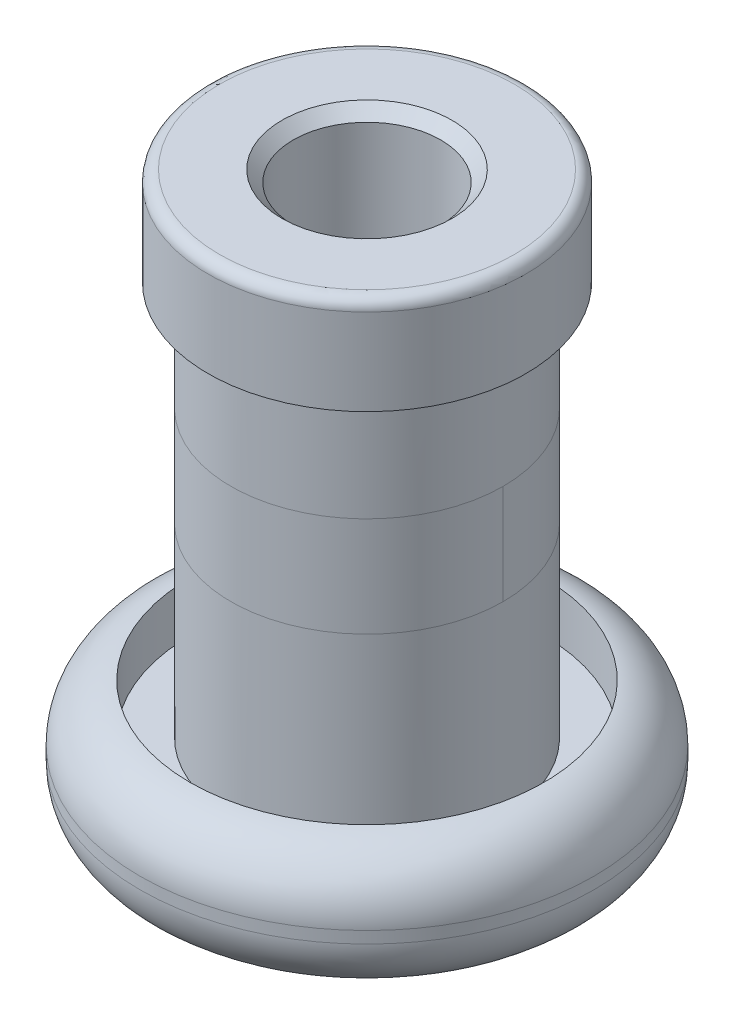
ISO-10303-21;
HEADER;
FILE_DESCRIPTION(('STEP AP214'),'2;1');
FILE_NAME('part.step','',(''),(''),'','','');
FILE_SCHEMA(('AUTOMOTIVE_DESIGN { 1 0 10303 214 1 1 1 1 }'));
ENDSEC;
DATA;
#1=APPLICATION_CONTEXT('core data for automotive mechanical design processes');
#2=APPLICATION_PROTOCOL_DEFINITION('international standard','automotive_design',2000,#1);
#3=PRODUCT_CONTEXT('',#1,'mechanical');
#4=PRODUCT('Part','Part','',(#3));
#5=PRODUCT_RELATED_PRODUCT_CATEGORY('part','',(#4));
#6=PRODUCT_DEFINITION_FORMATION('','',#4);
#7=PRODUCT_DEFINITION_CONTEXT('part definition',#1,'design');
#8=PRODUCT_DEFINITION('design','',#6,#7);
#9=PRODUCT_DEFINITION_SHAPE('','',#8);
#10=(LENGTH_UNIT() NAMED_UNIT(*) SI_UNIT(.MILLI.,.METRE.));
#11=(NAMED_UNIT(*) PLANE_ANGLE_UNIT() SI_UNIT($,.RADIAN.));
#12=(NAMED_UNIT(*) SI_UNIT($,.STERADIAN.) SOLID_ANGLE_UNIT());
#13=UNCERTAINTY_MEASURE_WITH_UNIT(LENGTH_MEASURE(1.E-05),#10,'distance_accuracy_value','');
#14=(GEOMETRIC_REPRESENTATION_CONTEXT(3) GLOBAL_UNCERTAINTY_ASSIGNED_CONTEXT((#13)) GLOBAL_UNIT_ASSIGNED_CONTEXT((#10,
#11,#12)) REPRESENTATION_CONTEXT('',''));
#15=CARTESIAN_POINT('',(0.,0.,0.));
#16=DIRECTION('',(0.,0.,1.));
#17=DIRECTION('',(1.,0.,0.));
#18=AXIS2_PLACEMENT_3D('',#15,#16,#17);
#19=CARTESIAN_POINT('',(0.,0.,0.));
#20=DIRECTION('',(0.,-1.,0.));
#21=DIRECTION('',(0.,0.,-1.));
#22=AXIS2_PLACEMENT_3D('',#19,#20,#21);
#23=CYLINDRICAL_SURFACE('',#22,7.62);
#24=CARTESIAN_POINT('',(0.,14.605,0.));
#25=DIRECTION('',(0.,1.,0.));
#26=DIRECTION('',(0.,0.,1.));
#27=AXIS2_PLACEMENT_3D('',#24,#25,#26);
#28=CIRCLE('',#27,7.62);
#29=CARTESIAN_POINT('',(-7.62,14.605,0.));
#30=VERTEX_POINT('',#29);
#31=CARTESIAN_POINT('',(7.62,14.605,0.));
#32=VERTEX_POINT('',#31);
#33=EDGE_CURVE('E43',#30,#32,#28,.F.);
#34=ORIENTED_EDGE('',*,*,#33,.F.);
#35=DIRECTION('',(0.,-1.,0.));
#36=VECTOR('',#35,1.);
#37=CARTESIAN_POINT('',(-7.62,0.,0.));
#38=LINE('',#37,#36);
#39=CARTESIAN_POINT('',(-7.62,20.193,0.));
#40=VERTEX_POINT('',#39);
#41=EDGE_CURVE('E11',#30,#40,#38,.F.);
#42=ORIENTED_EDGE('',*,*,#41,.T.);
#43=CARTESIAN_POINT('',(0.,20.193,0.));
#44=DIRECTION('',(0.,-1.,0.));
#45=DIRECTION('',(0.,0.,-1.));
#46=AXIS2_PLACEMENT_3D('',#43,#44,#45);
#47=CIRCLE('',#46,7.62);
#48=CARTESIAN_POINT('',(7.62,20.193,0.));
#49=VERTEX_POINT('',#48);
#50=EDGE_CURVE('E71',#49,#40,#47,.F.);
#51=ORIENTED_EDGE('',*,*,#50,.F.);
#52=DIRECTION('',(0.,-1.,0.));
#53=VECTOR('',#52,1.);
#54=CARTESIAN_POINT('',(7.62,0.,0.));
#55=LINE('',#54,#53);
#56=EDGE_CURVE('E59',#32,#49,#55,.F.);
#57=ORIENTED_EDGE('',*,*,#56,.F.);
#58=EDGE_LOOP('',(#34,#42,#51,#57));
#59=FACE_BOUND('',#58,.T.);
#60=ADVANCED_FACE('F34',(#59),#23,.T.);
#61=CARTESIAN_POINT('',(0.,4.191,0.));
#62=DIRECTION('',(0.,-1.,0.));
#63=DIRECTION('',(0.,0.,-1.));
#64=AXIS2_PLACEMENT_3D('',#61,#62,#63);
#65=CIRCLE('',#64,7.62);
#66=CARTESIAN_POINT('',(0.,4.191,-7.62));
#67=VERTEX_POINT('',#66);
#68=EDGE_CURVE('E161',#67,#67,#65,.T.);
#69=ORIENTED_EDGE('',*,*,#68,.F.);
#70=EDGE_LOOP('',(#69));
#71=FACE_BOUND('',#70,.T.);
#72=EDGE_CURVE('E64',#32,#30,#28,.F.);
#73=ORIENTED_EDGE('',*,*,#72,.T.);
#74=ORIENTED_EDGE('',*,*,#33,.T.);
#75=EDGE_LOOP('',(#73,#74));
#76=FACE_BOUND('',#75,.T.);
#77=ADVANCED_FACE('F94',(#71,#76),#23,.T.);
#78=CARTESIAN_POINT('',(0.,26.289,0.));
#79=DIRECTION('',(0.,-1.,0.));
#80=DIRECTION('',(0.,0.,-1.));
#81=AXIS2_PLACEMENT_3D('',#78,#79,#80);
#82=CIRCLE('',#81,7.62);
#83=CARTESIAN_POINT('',(0.,26.289,-7.62));
#84=VERTEX_POINT('',#83);
#85=EDGE_CURVE('E158',#84,#84,#82,.T.);
#86=ORIENTED_EDGE('',*,*,#85,.T.);
#87=EDGE_LOOP('',(#86));
#88=FACE_BOUND('',#87,.T.);
#89=ORIENTED_EDGE('',*,*,#50,.T.);
#90=EDGE_CURVE('E62',#40,#49,#47,.F.);
#91=ORIENTED_EDGE('',*,*,#90,.T.);
#92=EDGE_LOOP('',(#89,#91));
#93=FACE_BOUND('',#92,.T.);
#94=ADVANCED_FACE('F70',(#88,#93),#23,.T.);
#95=CARTESIAN_POINT('',(0.,3.83294289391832,0.));
#96=DIRECTION('',(0.,-1.,0.));
#97=DIRECTION('',(0.,0.,-1.));
#98=AXIS2_PLACEMENT_3D('',#95,#96,#97);
#99=TOROIDAL_SURFACE('',#98,9.525,3.175);
#100=CARTESIAN_POINT('',(0.,6.985,0.));
#101=DIRECTION('',(0.,-1.,0.));
#102=DIRECTION('',(0.,0.,-1.));
#103=AXIS2_PLACEMENT_3D('',#100,#101,#102);
#104=CIRCLE('',#103,9.906);
#105=CARTESIAN_POINT('',(0.,6.985,-9.906));
#106=VERTEX_POINT('',#105);
#107=EDGE_CURVE('E127',#106,#106,#104,.T.);
#108=ORIENTED_EDGE('',*,*,#107,.T.);
#109=EDGE_LOOP('',(#108));
#110=FACE_BOUND('',#109,.T.);
#111=CARTESIAN_POINT('',(0.,3.83294289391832,0.));
#112=DIRECTION('',(0.,-1.,0.));
#113=DIRECTION('',(0.,0.,-1.));
#114=AXIS2_PLACEMENT_3D('',#111,#112,#113);
#115=CIRCLE('',#114,12.7);
#116=CARTESIAN_POINT('',(0.,3.83294289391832,-12.7));
#117=VERTEX_POINT('',#116);
#118=EDGE_CURVE('E130',#117,#117,#115,.T.);
#119=ORIENTED_EDGE('',*,*,#118,.F.);
#120=EDGE_LOOP('',(#119));
#121=FACE_BOUND('',#120,.T.);
#122=ADVANCED_FACE('F103',(#110,#121),#99,.T.);
#123=CARTESIAN_POINT('',(0.,0.,0.));
#124=DIRECTION('',(0.,-1.,0.));
#125=DIRECTION('',(0.,0.,-1.));
#126=AXIS2_PLACEMENT_3D('',#123,#124,#125);
#127=CYLINDRICAL_SURFACE('',#126,9.906);
#128=CARTESIAN_POINT('',(0.,4.191,0.));
#129=DIRECTION('',(0.,-1.,0.));
#130=DIRECTION('',(0.,0.,-1.));
#131=AXIS2_PLACEMENT_3D('',#128,#129,#130);
#132=CIRCLE('',#131,9.906);
#133=CARTESIAN_POINT('',(0.,4.191,-9.906));
#134=VERTEX_POINT('',#133);
#135=EDGE_CURVE('E164',#134,#134,#132,.T.);
#136=ORIENTED_EDGE('',*,*,#135,.T.);
#137=EDGE_LOOP('',(#136));
#138=FACE_BOUND('',#137,.T.);
#139=ORIENTED_EDGE('',*,*,#107,.F.);
#140=EDGE_LOOP('',(#139));
#141=FACE_BOUND('',#140,.T.);
#142=ADVANCED_FACE('F114',(#138,#141),#127,.F.);
#143=CARTESIAN_POINT('',(7.62,4.191,0.));
#144=DIRECTION('',(0.,1.,0.));
#145=DIRECTION('',(0.,0.,1.));
#146=AXIS2_PLACEMENT_3D('',#143,#144,#145);
#147=PLANE('',#146);
#148=ORIENTED_EDGE('',*,*,#68,.T.);
#149=EDGE_LOOP('',(#148));
#150=FACE_BOUND('',#149,.T.);
#151=ORIENTED_EDGE('',*,*,#135,.F.);
#152=EDGE_LOOP('',(#151));
#153=FACE_BOUND('',#152,.T.);
#154=ADVANCED_FACE('F110',(#150,#153),#147,.T.);
#155=ORIENTED_EDGE('',*,*,#41,.F.);
#156=ORIENTED_EDGE('',*,*,#72,.F.);
#157=ORIENTED_EDGE('',*,*,#56,.T.);
#158=ORIENTED_EDGE('',*,*,#90,.F.);
#159=EDGE_LOOP('',(#155,#156,#157,#158));
#160=FACE_BOUND('',#159,.T.);
#161=ADVANCED_FACE('F61',(#160),#23,.T.);
#162=CARTESIAN_POINT('',(8.89,26.289,0.));
#163=DIRECTION('',(0.,-1.,0.));
#164=DIRECTION('',(0.,0.,-1.));
#165=AXIS2_PLACEMENT_3D('',#162,#163,#164);
#166=PLANE('',#165);
#167=CARTESIAN_POINT('',(0.,26.289,0.));
#168=DIRECTION('',(0.,-1.,0.));
#169=DIRECTION('',(0.,0.,-1.));
#170=AXIS2_PLACEMENT_3D('',#167,#168,#169);
#171=CIRCLE('',#170,8.89);
#172=CARTESIAN_POINT('',(0.,26.289,-8.89));
#173=VERTEX_POINT('',#172);
#174=EDGE_CURVE('E155',#173,#173,#171,.T.);
#175=ORIENTED_EDGE('',*,*,#174,.T.);
#176=EDGE_LOOP('',(#175));
#177=FACE_BOUND('',#176,.T.);
#178=ORIENTED_EDGE('',*,*,#85,.F.);
#179=EDGE_LOOP('',(#178));
#180=FACE_BOUND('',#179,.T.);
#181=ADVANCED_FACE('F109',(#177,#180),#166,.T.);
#182=CARTESIAN_POINT('',(0.,0.,0.));
#183=DIRECTION('',(0.,-1.,0.));
#184=DIRECTION('',(0.,0.,-1.));
#185=AXIS2_PLACEMENT_3D('',#182,#183,#184);
#186=CYLINDRICAL_SURFACE('',#185,8.89);
#187=CARTESIAN_POINT('',(0.,31.115,0.));
#188=DIRECTION('',(0.,-1.,0.));
#189=DIRECTION('',(0.,0.,-1.));
#190=AXIS2_PLACEMENT_3D('',#187,#188,#189);
#191=CIRCLE('',#190,8.89);
#192=CARTESIAN_POINT('',(0.,31.115,-8.89));
#193=VERTEX_POINT('',#192);
#194=EDGE_CURVE('E152',#193,#193,#191,.T.);
#195=ORIENTED_EDGE('',*,*,#194,.T.);
#196=EDGE_LOOP('',(#195));
#197=FACE_BOUND('',#196,.T.);
#198=ORIENTED_EDGE('',*,*,#174,.F.);
#199=EDGE_LOOP('',(#198));
#200=FACE_BOUND('',#199,.T.);
#201=ADVANCED_FACE('F205',(#197,#200),#186,.T.);
#202=CARTESIAN_POINT('',(0.,31.115,0.));
#203=DIRECTION('',(0.,-1.,0.));
#204=DIRECTION('',(0.,0.,-1.));
#205=AXIS2_PLACEMENT_3D('',#202,#203,#204);
#206=TOROIDAL_SURFACE('',#205,8.255,0.635);
#207=CARTESIAN_POINT('',(0.,31.75,0.));
#208=DIRECTION('',(0.,-1.,0.));
#209=DIRECTION('',(0.,0.,-1.));
#210=AXIS2_PLACEMENT_3D('',#207,#208,#209);
#211=CIRCLE('',#210,8.255);
#212=CARTESIAN_POINT('',(0.,31.75,-8.255));
#213=VERTEX_POINT('',#212);
#214=EDGE_CURVE('E149',#213,#213,#211,.T.);
#215=ORIENTED_EDGE('',*,*,#214,.T.);
#216=EDGE_LOOP('',(#215));
#217=FACE_BOUND('',#216,.T.);
#218=ORIENTED_EDGE('',*,*,#194,.F.);
#219=EDGE_LOOP('',(#218));
#220=FACE_BOUND('',#219,.T.);
#221=ADVANCED_FACE('F203',(#217,#220),#206,.T.);
#222=CARTESIAN_POINT('',(4.1275,31.75,0.));
#223=DIRECTION('',(0.,1.,0.));
#224=DIRECTION('',(0.,0.,1.));
#225=AXIS2_PLACEMENT_3D('',#222,#223,#224);
#226=PLANE('',#225);
#227=CARTESIAN_POINT('',(0.,31.75,0.));
#228=DIRECTION('',(0.,1.,0.));
#229=DIRECTION('',(0.,0.,1.));
#230=AXIS2_PLACEMENT_3D('',#227,#228,#229);
#231=CIRCLE('',#230,4.7625);
#232=CARTESIAN_POINT('',(0.,31.75,4.7625));
#233=VERTEX_POINT('',#232);
#234=EDGE_CURVE('E79',#233,#233,#231,.F.);
#235=ORIENTED_EDGE('',*,*,#234,.T.);
#236=EDGE_LOOP('',(#235));
#237=FACE_BOUND('',#236,.T.);
#238=ORIENTED_EDGE('',*,*,#214,.F.);
#239=EDGE_LOOP('',(#238));
#240=FACE_BOUND('',#239,.T.);
#241=ADVANCED_FACE('F170',(#237,#240),#226,.T.);
#242=CARTESIAN_POINT('',(0.,0.,0.));
#243=DIRECTION('',(0.,-1.,0.));
#244=DIRECTION('',(0.,0.,-1.));
#245=AXIS2_PLACEMENT_3D('',#242,#243,#244);
#246=CYLINDRICAL_SURFACE('',#245,4.1275);
#247=CARTESIAN_POINT('',(0.,31.115,0.));
#248=DIRECTION('',(0.,1.,0.));
#249=DIRECTION('',(0.,0.,1.));
#250=AXIS2_PLACEMENT_3D('',#247,#248,#249);
#251=CIRCLE('',#250,4.1275);
#252=CARTESIAN_POINT('',(0.,31.115,4.1275));
#253=VERTEX_POINT('',#252);
#254=EDGE_CURVE('E75',#253,#253,#251,.T.);
#255=ORIENTED_EDGE('',*,*,#254,.T.);
#256=EDGE_LOOP('',(#255));
#257=FACE_BOUND('',#256,.T.);
#258=CARTESIAN_POINT('',(0.,3.175,0.));
#259=DIRECTION('',(0.,-1.,0.));
#260=DIRECTION('',(0.,0.,-1.));
#261=AXIS2_PLACEMENT_3D('',#258,#259,#260);
#262=CIRCLE('',#261,4.1275);
#263=CARTESIAN_POINT('',(0.,3.175,-4.1275));
#264=VERTEX_POINT('',#263);
#265=EDGE_CURVE('E146',#264,#264,#262,.T.);
#266=ORIENTED_EDGE('',*,*,#265,.T.);
#267=EDGE_LOOP('',(#266));
#268=FACE_BOUND('',#267,.T.);
#269=ADVANCED_FACE('F183',(#257,#268),#246,.F.);
#270=CARTESIAN_POINT('',(5.3975,3.175,0.));
#271=DIRECTION('',(0.,-1.,0.));
#272=DIRECTION('',(0.,0.,-1.));
#273=AXIS2_PLACEMENT_3D('',#270,#271,#272);
#274=PLANE('',#273);
#275=CARTESIAN_POINT('',(0.,3.175,0.));
#276=DIRECTION('',(0.,-1.,0.));
#277=DIRECTION('',(0.,0.,-1.));
#278=AXIS2_PLACEMENT_3D('',#275,#276,#277);
#279=CIRCLE('',#278,5.3975);
#280=CARTESIAN_POINT('',(0.,3.175,-5.3975));
#281=VERTEX_POINT('',#280);
#282=EDGE_CURVE('E143',#281,#281,#279,.T.);
#283=ORIENTED_EDGE('',*,*,#282,.T.);
#284=EDGE_LOOP('',(#283));
#285=FACE_BOUND('',#284,.T.);
#286=ORIENTED_EDGE('',*,*,#265,.F.);
#287=EDGE_LOOP('',(#286));
#288=FACE_BOUND('',#287,.T.);
#289=ADVANCED_FACE('F186',(#285,#288),#274,.T.);
#290=CARTESIAN_POINT('',(0.,0.,0.));
#291=DIRECTION('',(0.,-1.,0.));
#292=DIRECTION('',(0.,0.,-1.));
#293=AXIS2_PLACEMENT_3D('',#290,#291,#292);
#294=CYLINDRICAL_SURFACE('',#293,5.3975);
#295=CARTESIAN_POINT('',(0.,0.,0.));
#296=DIRECTION('',(0.,-1.,0.));
#297=DIRECTION('',(0.,0.,-1.));
#298=AXIS2_PLACEMENT_3D('',#295,#296,#297);
#299=CIRCLE('',#298,5.3975);
#300=CARTESIAN_POINT('',(0.,0.,-5.3975));
#301=VERTEX_POINT('',#300);
#302=EDGE_CURVE('E140',#301,#301,#299,.T.);
#303=ORIENTED_EDGE('',*,*,#302,.T.);
#304=EDGE_LOOP('',(#303));
#305=FACE_BOUND('',#304,.T.);
#306=ORIENTED_EDGE('',*,*,#282,.F.);
#307=EDGE_LOOP('',(#306));
#308=FACE_BOUND('',#307,.T.);
#309=ADVANCED_FACE('F191',(#305,#308),#294,.F.);
#310=CARTESIAN_POINT('',(5.3975,0.,0.));
#311=DIRECTION('',(0.,-1.,0.));
#312=DIRECTION('',(0.,0.,-1.));
#313=AXIS2_PLACEMENT_3D('',#310,#311,#312);
#314=PLANE('',#313);
#315=CARTESIAN_POINT('',(0.,0.,0.));
#316=DIRECTION('',(0.,-1.,0.));
#317=DIRECTION('',(0.,0.,-1.));
#318=AXIS2_PLACEMENT_3D('',#315,#316,#317);
#319=CIRCLE('',#318,9.525);
#320=CARTESIAN_POINT('',(0.,0.,-9.525));
#321=VERTEX_POINT('',#320);
#322=EDGE_CURVE('E135',#321,#321,#319,.T.);
#323=ORIENTED_EDGE('',*,*,#322,.T.);
#324=EDGE_LOOP('',(#323));
#325=FACE_BOUND('',#324,.T.);
#326=ORIENTED_EDGE('',*,*,#302,.F.);
#327=EDGE_LOOP('',(#326));
#328=FACE_BOUND('',#327,.T.);
#329=ADVANCED_FACE('F197',(#325,#328),#314,.T.);
#330=CARTESIAN_POINT('',(0.,3.175,0.));
#331=DIRECTION('',(0.,-1.,0.));
#332=DIRECTION('',(0.,0.,-1.));
#333=AXIS2_PLACEMENT_3D('',#330,#331,#332);
#334=TOROIDAL_SURFACE('',#333,9.525,3.175);
#335=CARTESIAN_POINT('',(0.,3.175,0.));
#336=DIRECTION('',(0.,-1.,0.));
#337=DIRECTION('',(0.,0.,-1.));
#338=AXIS2_PLACEMENT_3D('',#335,#336,#337);
#339=CIRCLE('',#338,12.7);
#340=CARTESIAN_POINT('',(0.,3.175,-12.7));
#341=VERTEX_POINT('',#340);
#342=EDGE_CURVE('E132',#341,#341,#339,.T.);
#343=ORIENTED_EDGE('',*,*,#342,.T.);
#344=EDGE_LOOP('',(#343));
#345=FACE_BOUND('',#344,.T.);
#346=ORIENTED_EDGE('',*,*,#322,.F.);
#347=EDGE_LOOP('',(#346));
#348=FACE_BOUND('',#347,.T.);
#349=ADVANCED_FACE('F179',(#345,#348),#334,.T.);
#350=CARTESIAN_POINT('',(0.,0.,0.));
#351=DIRECTION('',(0.,-1.,0.));
#352=DIRECTION('',(0.,0.,-1.));
#353=AXIS2_PLACEMENT_3D('',#350,#351,#352);
#354=CYLINDRICAL_SURFACE('',#353,12.7);
#355=ORIENTED_EDGE('',*,*,#118,.T.);
#356=EDGE_LOOP('',(#355));
#357=FACE_BOUND('',#356,.T.);
#358=ORIENTED_EDGE('',*,*,#342,.F.);
#359=EDGE_LOOP('',(#358));
#360=FACE_BOUND('',#359,.T.);
#361=ADVANCED_FACE('F174',(#357,#360),#354,.T.);
#362=CARTESIAN_POINT('',(0.,31.75,0.));
#363=DIRECTION('',(0.,1.,0.));
#364=DIRECTION('',(0.,0.,1.));
#365=AXIS2_PLACEMENT_3D('',#362,#363,#364);
#366=CONICAL_SURFACE('',#365,4.7625,0.785398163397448);
#367=ORIENTED_EDGE('',*,*,#254,.F.);
#368=EDGE_LOOP('',(#367));
#369=FACE_BOUND('',#368,.T.);
#370=ORIENTED_EDGE('',*,*,#234,.F.);
#371=EDGE_LOOP('',(#370));
#372=FACE_BOUND('',#371,.T.);
#373=ADVANCED_FACE('F36',(#369,#372),#366,.F.);
#374=CLOSED_SHELL('',(#60,#77,#94,#122,#142,#154,#161,#181,#201,#221,#241,#269,#289,#309,#329,
#349,#361,#373));
#375=MANIFOLD_SOLID_BREP('B2',#374);
#376=ADVANCED_BREP_SHAPE_REPRESENTATION('',(#18,#375),#14);
#377=SHAPE_DEFINITION_REPRESENTATION(#9,#376);
ENDSEC;
END-ISO-10303-21;
